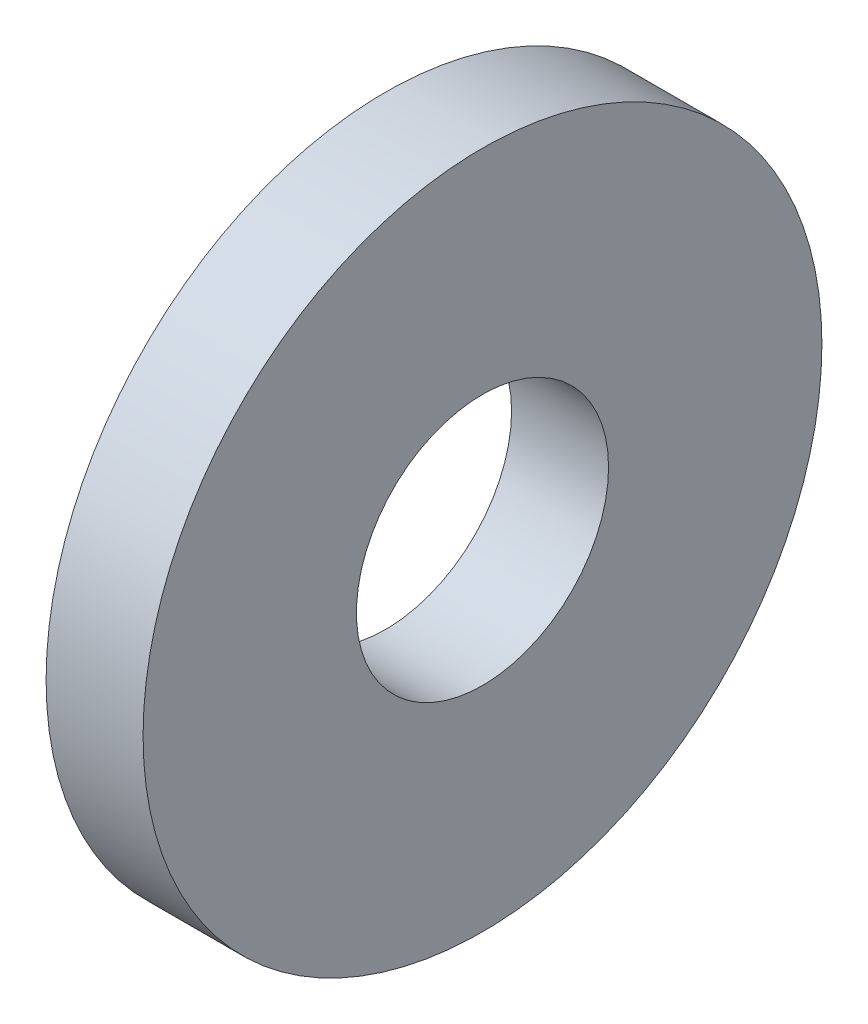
from build123d import *

# Parameters (mm, degrees)
SKETCH1_R          = 17.5
SKETCH1_R_2        = 6.5
BASE_EXTRUDE_DEPTH = 5


with BuildPart() as part:
    # Sketch1 → Base-Extrude (new body)
    with BuildSketch(Plane(origin=(0, 0, 0), x_dir=(0, 0, -1), z_dir=(1, 0, 0))):
        with Locations((0.573716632, -0.860574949)):
            Circle(SKETCH1_R)
        with Locations((0.573716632, -0.860574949)):
            Circle(SKETCH1_R_2, mode=Mode.SUBTRACT)
    extrude(amount=BASE_EXTRUDE_DEPTH)


solid = part.part
